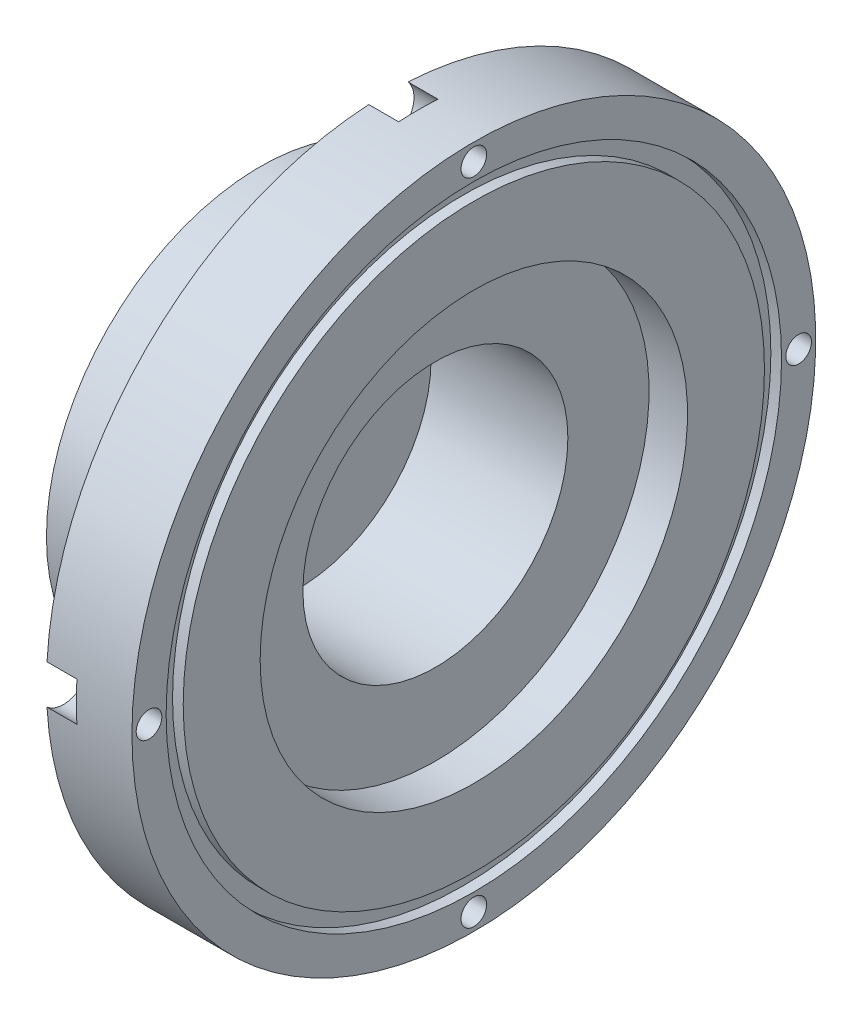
ISO-10303-21;
HEADER;
FILE_DESCRIPTION(('STEP AP214'),'2;1');
FILE_NAME('part.step','',(''),(''),'','','');
FILE_SCHEMA(('AUTOMOTIVE_DESIGN { 1 0 10303 214 1 1 1 1 }'));
ENDSEC;
DATA;
#1=APPLICATION_CONTEXT('core data for automotive mechanical design processes');
#2=APPLICATION_PROTOCOL_DEFINITION('international standard','automotive_design',2000,#1);
#3=PRODUCT_CONTEXT('',#1,'mechanical');
#4=PRODUCT('Part','Part','',(#3));
#5=PRODUCT_RELATED_PRODUCT_CATEGORY('part','',(#4));
#6=PRODUCT_DEFINITION_FORMATION('','',#4);
#7=PRODUCT_DEFINITION_CONTEXT('part definition',#1,'design');
#8=PRODUCT_DEFINITION('design','',#6,#7);
#9=PRODUCT_DEFINITION_SHAPE('','',#8);
#10=(LENGTH_UNIT() NAMED_UNIT(*) SI_UNIT(.MILLI.,.METRE.));
#11=(NAMED_UNIT(*) PLANE_ANGLE_UNIT() SI_UNIT($,.RADIAN.));
#12=(NAMED_UNIT(*) SI_UNIT($,.STERADIAN.) SOLID_ANGLE_UNIT());
#13=UNCERTAINTY_MEASURE_WITH_UNIT(LENGTH_MEASURE(1.E-05),#10,'distance_accuracy_value','');
#14=(GEOMETRIC_REPRESENTATION_CONTEXT(3) GLOBAL_UNCERTAINTY_ASSIGNED_CONTEXT((#13)) GLOBAL_UNIT_ASSIGNED_CONTEXT((#10,
#11,#12)) REPRESENTATION_CONTEXT('',''));
#15=CARTESIAN_POINT('',(0.,0.,0.));
#16=DIRECTION('',(0.,0.,1.));
#17=DIRECTION('',(1.,0.,0.));
#18=AXIS2_PLACEMENT_3D('',#15,#16,#17);
#19=CARTESIAN_POINT('',(25.001,3.98028872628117E-13,38.));
#20=DIRECTION('',(-1.,0.,0.));
#21=DIRECTION('',(0.,0.,1.));
#22=AXIS2_PLACEMENT_3D('',#19,#20,#21);
#23=CYLINDRICAL_SURFACE('',#22,1.5);
#24=CARTESIAN_POINT('',(25.,3.98028872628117E-13,38.));
#25=DIRECTION('',(-1.,0.,0.));
#26=DIRECTION('',(0.,0.,1.));
#27=AXIS2_PLACEMENT_3D('',#24,#25,#26);
#28=CIRCLE('',#27,1.5);
#29=CARTESIAN_POINT('',(25.,3.98028872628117E-13,39.5));
#30=VERTEX_POINT('',#29);
#31=EDGE_CURVE('E198',#30,#30,#28,.F.);
#32=ORIENTED_EDGE('',*,*,#31,.T.);
#33=EDGE_LOOP('',(#32));
#34=FACE_BOUND('',#33,.T.);
#35=CARTESIAN_POINT('',(18.5,3.98028872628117E-13,38.));
#36=DIRECTION('',(-1.,0.,0.));
#37=DIRECTION('',(0.,0.,1.));
#38=AXIS2_PLACEMENT_3D('',#35,#36,#37);
#39=CIRCLE('',#38,1.5);
#40=CARTESIAN_POINT('',(18.5,3.98028872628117E-13,39.5));
#41=VERTEX_POINT('',#40);
#42=EDGE_CURVE('E226',#41,#41,#39,.F.);
#43=ORIENTED_EDGE('',*,*,#42,.F.);
#44=EDGE_LOOP('',(#43));
#45=FACE_BOUND('',#44,.T.);
#46=ADVANCED_FACE('F44',(#34,#45),#23,.F.);
#47=CARTESIAN_POINT('',(25.001,-38.,0.));
#48=DIRECTION('',(-1.,0.,0.));
#49=DIRECTION('',(0.,0.,1.));
#50=AXIS2_PLACEMENT_3D('',#47,#48,#49);
#51=CYLINDRICAL_SURFACE('',#50,1.5);
#52=CARTESIAN_POINT('',(25.,-38.,0.));
#53=DIRECTION('',(-1.,0.,0.));
#54=DIRECTION('',(0.,0.,1.));
#55=AXIS2_PLACEMENT_3D('',#52,#53,#54);
#56=CIRCLE('',#55,1.5);
#57=CARTESIAN_POINT('',(25.,-38.,1.5));
#58=VERTEX_POINT('',#57);
#59=EDGE_CURVE('E202',#58,#58,#56,.F.);
#60=ORIENTED_EDGE('',*,*,#59,.T.);
#61=EDGE_LOOP('',(#60));
#62=FACE_BOUND('',#61,.T.);
#63=CARTESIAN_POINT('',(18.5,-38.,0.));
#64=DIRECTION('',(-1.,0.,0.));
#65=DIRECTION('',(0.,0.,1.));
#66=AXIS2_PLACEMENT_3D('',#63,#64,#65);
#67=CIRCLE('',#66,1.5);
#68=CARTESIAN_POINT('',(18.5,-38.,1.5));
#69=VERTEX_POINT('',#68);
#70=EDGE_CURVE('E230',#69,#69,#67,.F.);
#71=ORIENTED_EDGE('',*,*,#70,.F.);
#72=EDGE_LOOP('',(#71));
#73=FACE_BOUND('',#72,.T.);
#74=ADVANCED_FACE('F284',(#62,#73),#51,.F.);
#75=CARTESIAN_POINT('',(25.001,-1.32676290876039E-13,-38.));
#76=DIRECTION('',(-1.,0.,0.));
#77=DIRECTION('',(0.,0.,1.));
#78=AXIS2_PLACEMENT_3D('',#75,#76,#77);
#79=CYLINDRICAL_SURFACE('',#78,1.5);
#80=CARTESIAN_POINT('',(25.,-1.32676290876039E-13,-38.));
#81=DIRECTION('',(-1.,0.,0.));
#82=DIRECTION('',(0.,0.,1.));
#83=AXIS2_PLACEMENT_3D('',#80,#81,#82);
#84=CIRCLE('',#83,1.5);
#85=CARTESIAN_POINT('',(25.,-1.32676290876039E-13,-36.5));
#86=VERTEX_POINT('',#85);
#87=EDGE_CURVE('E194',#86,#86,#84,.F.);
#88=ORIENTED_EDGE('',*,*,#87,.T.);
#89=EDGE_LOOP('',(#88));
#90=FACE_BOUND('',#89,.T.);
#91=CARTESIAN_POINT('',(18.5,-1.32676290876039E-13,-38.));
#92=DIRECTION('',(-1.,0.,0.));
#93=DIRECTION('',(0.,0.,1.));
#94=AXIS2_PLACEMENT_3D('',#91,#92,#93);
#95=CIRCLE('',#94,1.5);
#96=CARTESIAN_POINT('',(18.5,-1.32676290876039E-13,-36.5));
#97=VERTEX_POINT('',#96);
#98=EDGE_CURVE('E233',#97,#97,#95,.F.);
#99=ORIENTED_EDGE('',*,*,#98,.F.);
#100=EDGE_LOOP('',(#99));
#101=FACE_BOUND('',#100,.T.);
#102=ADVANCED_FACE('F291',(#90,#101),#79,.F.);
#103=CARTESIAN_POINT('',(25.001,38.,0.));
#104=DIRECTION('',(-1.,0.,0.));
#105=DIRECTION('',(0.,0.,1.));
#106=AXIS2_PLACEMENT_3D('',#103,#104,#105);
#107=CYLINDRICAL_SURFACE('',#106,1.5);
#108=CARTESIAN_POINT('',(25.,38.,0.));
#109=DIRECTION('',(-1.,0.,0.));
#110=DIRECTION('',(0.,0.,1.));
#111=AXIS2_PLACEMENT_3D('',#108,#109,#110);
#112=CIRCLE('',#111,1.5);
#113=CARTESIAN_POINT('',(25.,38.,1.5));
#114=VERTEX_POINT('',#113);
#115=EDGE_CURVE('E176',#114,#114,#112,.F.);
#116=ORIENTED_EDGE('',*,*,#115,.T.);
#117=EDGE_LOOP('',(#116));
#118=FACE_BOUND('',#117,.T.);
#119=CARTESIAN_POINT('',(18.5,38.,0.));
#120=DIRECTION('',(-1.,0.,0.));
#121=DIRECTION('',(0.,0.,1.));
#122=AXIS2_PLACEMENT_3D('',#119,#120,#121);
#123=CIRCLE('',#122,1.5);
#124=CARTESIAN_POINT('',(18.5,38.,1.5));
#125=VERTEX_POINT('',#124);
#126=EDGE_CURVE('E190',#125,#125,#123,.F.);
#127=ORIENTED_EDGE('',*,*,#126,.F.);
#128=EDGE_LOOP('',(#127));
#129=FACE_BOUND('',#128,.T.);
#130=ADVANCED_FACE('F306',(#118,#129),#107,.F.);
#131=CARTESIAN_POINT('',(0.,0.,0.));
#132=DIRECTION('',(-1.,0.,0.));
#133=DIRECTION('',(0.,0.,1.));
#134=AXIS2_PLACEMENT_3D('',#131,#132,#133);
#135=CYLINDRICAL_SURFACE('',#134,15.5);
#136=CARTESIAN_POINT('',(9.99604881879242,15.2222149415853,2.92133056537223));
#137=CARTESIAN_POINT('',(10.1492075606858,15.2222178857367,2.92132457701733));
#138=CARTESIAN_POINT('',(10.3024462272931,15.2246908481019,2.90851916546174));
#139=CARTESIAN_POINT('',(10.6046132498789,15.2343169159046,2.8576620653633));
#140=CARTESIAN_POINT('',(10.7535376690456,15.2414741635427,2.81958803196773));
#141=CARTESIAN_POINT('',(11.0426599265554,15.2596698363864,2.71938432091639));
#142=CARTESIAN_POINT('',(11.1828653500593,15.270704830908,2.65727590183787));
#143=CARTESIAN_POINT('',(11.4508338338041,15.2954672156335,2.51081140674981));
#144=CARTESIAN_POINT('',(11.578598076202,15.3091943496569,2.42645744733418));
#145=CARTESIAN_POINT('',(11.8194949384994,15.3380449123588,2.23688105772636));
#146=CARTESIAN_POINT('',(11.9324686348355,15.3531809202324,2.13145856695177));
#147=CARTESIAN_POINT('',(12.1391949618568,15.3831474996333,1.90315607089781));
#148=CARTESIAN_POINT('',(12.2329463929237,15.3979780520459,1.78027497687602));
#149=CARTESIAN_POINT('',(12.3991698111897,15.4259009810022,1.51949498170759));
#150=CARTESIAN_POINT('',(12.4714929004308,15.4389808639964,1.381499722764));
#151=CARTESIAN_POINT('',(12.5918484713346,15.4619370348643,1.09504484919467));
#152=CARTESIAN_POINT('',(12.6398827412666,15.4718135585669,0.946586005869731));
#153=CARTESIAN_POINT('',(12.7098083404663,15.4872995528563,0.645054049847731));
#154=CARTESIAN_POINT('',(12.7319671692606,15.4929524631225,0.492045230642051));
#155=CARTESIAN_POINT('',(12.7503455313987,15.4996667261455,0.184383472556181));
#156=CARTESIAN_POINT('',(12.7465670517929,15.5007284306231,0.0297306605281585));
#157=CARTESIAN_POINT('',(12.7133849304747,15.498301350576,-0.274996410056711));
#158=CARTESIAN_POINT('',(12.6842692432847,15.4948634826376,-0.425102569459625));
#159=CARTESIAN_POINT('',(12.6016936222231,15.4840424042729,-0.718309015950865));
#160=CARTESIAN_POINT('',(12.5482328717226,15.4766590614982,-0.861409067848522));
#161=CARTESIAN_POINT('',(12.4182044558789,15.4588358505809,-1.13737937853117));
#162=CARTESIAN_POINT('',(12.3415199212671,15.4483805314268,-1.27019352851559));
#163=CARTESIAN_POINT('',(12.1673065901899,15.4256884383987,-1.52119774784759));
#164=CARTESIAN_POINT('',(12.0697758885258,15.4134515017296,-1.63938647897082));
#165=CARTESIAN_POINT('',(11.8550467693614,15.3884631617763,-1.85947848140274));
#166=CARTESIAN_POINT('',(11.7375965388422,15.3757069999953,-1.96113568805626));
#167=CARTESIAN_POINT('',(11.487205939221,15.3513715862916,-2.14333036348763));
#168=CARTESIAN_POINT('',(11.3542653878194,15.3397923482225,-2.22386758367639));
#169=CARTESIAN_POINT('',(11.0763619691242,15.3191971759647,-2.36158347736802));
#170=CARTESIAN_POINT('',(10.9313825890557,15.3101848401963,-2.41872940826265));
#171=CARTESIAN_POINT('',(10.6336893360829,15.2958580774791,-2.50774366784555));
#172=CARTESIAN_POINT('',(10.4809762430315,15.2905432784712,-2.53961453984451));
#173=CARTESIAN_POINT('',(10.1743611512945,15.2843181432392,-2.57681477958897));
#174=CARTESIAN_POINT('',(10.0205031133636,15.2833492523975,-2.58249702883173));
#175=CARTESIAN_POINT('',(9.71403753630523,15.2857747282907,-2.5681009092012));
#176=CARTESIAN_POINT('',(9.56142994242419,15.28916890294,-2.5480236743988));
#177=CARTESIAN_POINT('',(9.26293557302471,15.2998644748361,-2.48298390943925));
#178=CARTESIAN_POINT('',(9.11700794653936,15.3071372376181,-2.43820367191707));
#179=CARTESIAN_POINT('',(8.83471338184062,15.3247042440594,-2.32522864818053));
#180=CARTESIAN_POINT('',(8.69834708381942,15.3349986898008,-2.25703229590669));
#181=CARTESIAN_POINT('',(8.43748658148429,15.357519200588,-2.0983489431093));
#182=CARTESIAN_POINT('',(8.31313050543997,15.369764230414,-2.00763762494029));
#183=CARTESIAN_POINT('',(8.08125416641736,15.3946621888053,-1.80681739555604));
#184=CARTESIAN_POINT('',(7.97373525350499,15.407315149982,-1.69670693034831));
#185=CARTESIAN_POINT('',(7.7772843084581,15.4316808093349,-1.45865827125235));
#186=CARTESIAN_POINT('',(7.68858816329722,15.4433805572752,-1.33052389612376));
#187=CARTESIAN_POINT('',(7.53395903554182,15.4642340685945,-1.06099406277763));
#188=CARTESIAN_POINT('',(7.4680252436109,15.4733879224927,-0.919599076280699));
#189=CARTESIAN_POINT('',(7.36115254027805,15.4879455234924,-0.628248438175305));
#190=CARTESIAN_POINT('',(7.32009401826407,15.4933672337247,-0.478337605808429));
#191=CARTESIAN_POINT('',(7.26375383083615,15.4997755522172,-0.173659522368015));
#192=CARTESIAN_POINT('',(7.24846974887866,15.5007625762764,-0.0188927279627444));
#193=CARTESIAN_POINT('',(7.24418918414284,15.4980621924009,0.288832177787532));
#194=CARTESIAN_POINT('',(7.25483513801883,15.4944386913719,0.441785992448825));
#195=CARTESIAN_POINT('',(7.30133416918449,15.482887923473,0.743640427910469));
#196=CARTESIAN_POINT('',(7.33718705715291,15.4749606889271,0.892541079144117));
#197=CARTESIAN_POINT('',(7.43293813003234,15.4555529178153,1.18190535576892));
#198=CARTESIAN_POINT('',(7.492802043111,15.4440774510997,1.32238067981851));
#199=CARTESIAN_POINT('',(7.63483458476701,15.4186891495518,1.59131761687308));
#200=CARTESIAN_POINT('',(7.71700449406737,15.4047761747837,1.71977853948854));
#201=CARTESIAN_POINT('',(7.90256577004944,15.3757097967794,1.9628409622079));
#202=CARTESIAN_POINT('',(8.0062172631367,15.3605427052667,2.07724225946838));
#203=CARTESIAN_POINT('',(8.23125623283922,15.3306944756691,2.28715464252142));
#204=CARTESIAN_POINT('',(8.35264786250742,15.3160134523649,2.38266129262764));
#205=CARTESIAN_POINT('',(8.61090043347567,15.2885797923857,2.55280962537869));
#206=CARTESIAN_POINT('',(8.74787932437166,15.2758438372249,2.62727501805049));
#207=CARTESIAN_POINT('',(9.03258686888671,15.2538596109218,2.7520564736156));
#208=CARTESIAN_POINT('',(9.18030491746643,15.2446079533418,2.80239599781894));
#209=CARTESIAN_POINT('',(9.43978365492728,15.2325795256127,2.86692311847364));
#210=CARTESIAN_POINT('',(9.54999817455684,15.2287142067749,2.88729223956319));
#211=CARTESIAN_POINT('',(9.77214385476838,15.2235308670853,2.91449800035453));
#212=CARTESIAN_POINT('',(9.88407497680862,15.2222127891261,2.9213349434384));
#213=CARTESIAN_POINT('',(9.99604881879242,15.2222149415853,2.92133056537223));
#214=B_SPLINE_CURVE_WITH_KNOTS('',3,(#136,#137,#138,#139,#140,#141,#142,#143,#144,#145,#146,
#147,#148,#149,#150,#151,#152,#153,#154,#155,#156,#157,#158,#159,#160,#161,#162,#163,#164,#165,
#166,#167,#168,#169,#170,#171,#172,#173,#174,#175,#176,#177,#178,#179,#180,#181,#182,#183,#184,
#185,#186,#187,#188,#189,#190,#191,#192,#193,#194,#195,#196,#197,#198,#199,#200,#201,#202,#203,
#204,#205,#206,#207,#208,#209,#210,#211,#212,#213),.UNSPECIFIED.,.T.,.F.,(4,2,2,2,2,2,2,2,2,2,2,
2,2,2,2,2,2,2,2,2,2,2,2,2,2,2,2,2,2,2,2,2,2,2,2,2,2,2,4),(0.,0.459066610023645,
0.918539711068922,1.37760733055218,1.83663128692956,2.30024096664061,2.7638795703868,
3.23066809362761,3.69742224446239,4.1593071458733,4.62115666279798,5.07782486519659,
5.53450838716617,5.99352938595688,6.45259235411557,6.91796260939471,7.38333834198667,
7.84936328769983,8.31534133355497,8.77502178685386,9.2346820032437,9.69099473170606,
10.1473379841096,10.6084243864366,11.069547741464,11.5361470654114,12.0027297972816,
12.4670508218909,12.931328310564,13.3892399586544,13.8471481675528,14.3044050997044,
14.7616882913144,15.224871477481,15.6881632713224,16.1552287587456,16.6218391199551,
16.9574687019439,17.2930907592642),.UNSPECIFIED.);
#215=CARTESIAN_POINT('',(9.99604881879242,15.2222149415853,2.92133056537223));
#216=VERTEX_POINT('',#215);
#217=EDGE_CURVE('E238',#216,#216,#214,.T.);
#218=ORIENTED_EDGE('',*,*,#217,.T.);
#219=EDGE_LOOP('',(#218));
#220=FACE_BOUND('',#219,.T.);
#221=CARTESIAN_POINT('',(20.5,0.,0.));
#222=DIRECTION('',(-1.,0.,0.));
#223=DIRECTION('',(0.,0.,1.));
#224=AXIS2_PLACEMENT_3D('',#221,#222,#223);
#225=CIRCLE('',#224,15.5);
#226=CARTESIAN_POINT('',(20.5,0.,15.5));
#227=VERTEX_POINT('',#226);
#228=EDGE_CURVE('E58',#227,#227,#225,.T.);
#229=ORIENTED_EDGE('',*,*,#228,.F.);
#230=EDGE_LOOP('',(#229));
#231=FACE_BOUND('',#230,.T.);
#232=CARTESIAN_POINT('',(4.5,0.,0.));
#233=DIRECTION('',(-1.,0.,0.));
#234=DIRECTION('',(0.,0.,1.));
#235=AXIS2_PLACEMENT_3D('',#232,#233,#234);
#236=CIRCLE('',#235,15.5);
#237=CARTESIAN_POINT('',(4.5,0.,15.5));
#238=VERTEX_POINT('',#237);
#239=EDGE_CURVE('E170',#238,#238,#236,.T.);
#240=ORIENTED_EDGE('',*,*,#239,.T.);
#241=EDGE_LOOP('',(#240));
#242=FACE_BOUND('',#241,.T.);
#243=ADVANCED_FACE('F46',(#220,#231,#242),#135,.F.);
#244=CARTESIAN_POINT('',(20.5,15.5,0.));
#245=DIRECTION('',(-1.,0.,0.));
#246=DIRECTION('',(0.,0.,1.));
#247=AXIS2_PLACEMENT_3D('',#244,#245,#246);
#248=PLANE('',#247);
#249=CARTESIAN_POINT('',(20.5,0.,0.));
#250=DIRECTION('',(-1.,0.,0.));
#251=DIRECTION('',(0.,0.,1.));
#252=AXIS2_PLACEMENT_3D('',#249,#250,#251);
#253=CIRCLE('',#252,25.);
#254=CARTESIAN_POINT('',(20.5,0.,25.));
#255=VERTEX_POINT('',#254);
#256=EDGE_CURVE('E359',#255,#255,#253,.T.);
#257=ORIENTED_EDGE('',*,*,#256,.F.);
#258=EDGE_LOOP('',(#257));
#259=FACE_BOUND('',#258,.T.);
#260=ORIENTED_EDGE('',*,*,#228,.T.);
#261=EDGE_LOOP('',(#260));
#262=FACE_BOUND('',#261,.T.);
#263=ADVANCED_FACE('F347',(#259,#262),#248,.F.);
#264=CARTESIAN_POINT('',(0.,0.,0.));
#265=DIRECTION('',(-1.,0.,0.));
#266=DIRECTION('',(0.,0.,1.));
#267=AXIS2_PLACEMENT_3D('',#264,#265,#266);
#268=CYLINDRICAL_SURFACE('',#267,25.);
#269=CARTESIAN_POINT('',(25.,0.,0.));
#270=DIRECTION('',(-1.,0.,0.));
#271=DIRECTION('',(0.,0.,1.));
#272=AXIS2_PLACEMENT_3D('',#269,#270,#271);
#273=CIRCLE('',#272,25.);
#274=CARTESIAN_POINT('',(25.,0.,25.));
#275=VERTEX_POINT('',#274);
#276=EDGE_CURVE('E366',#275,#275,#273,.T.);
#277=ORIENTED_EDGE('',*,*,#276,.F.);
#278=EDGE_LOOP('',(#277));
#279=FACE_BOUND('',#278,.T.);
#280=ORIENTED_EDGE('',*,*,#256,.T.);
#281=EDGE_LOOP('',(#280));
#282=FACE_BOUND('',#281,.T.);
#283=ADVANCED_FACE('F344',(#279,#282),#268,.F.);
#284=CARTESIAN_POINT('',(25.,25.,0.));
#285=DIRECTION('',(-1.,0.,0.));
#286=DIRECTION('',(0.,0.,1.));
#287=AXIS2_PLACEMENT_3D('',#284,#285,#286);
#288=PLANE('',#287);
#289=CARTESIAN_POINT('',(25.,0.,0.));
#290=DIRECTION('',(-1.,0.,0.));
#291=DIRECTION('',(0.,0.,1.));
#292=AXIS2_PLACEMENT_3D('',#289,#290,#291);
#293=CIRCLE('',#292,34.);
#294=CARTESIAN_POINT('',(25.,0.,34.));
#295=VERTEX_POINT('',#294);
#296=EDGE_CURVE('E650',#295,#295,#293,.T.);
#297=ORIENTED_EDGE('',*,*,#296,.F.);
#298=EDGE_LOOP('',(#297));
#299=FACE_BOUND('',#298,.T.);
#300=ORIENTED_EDGE('',*,*,#276,.T.);
#301=EDGE_LOOP('',(#300));
#302=FACE_BOUND('',#301,.T.);
#303=ADVANCED_FACE('F340',(#299,#302),#288,.F.);
#304=CARTESIAN_POINT('',(0.,0.,0.));
#305=DIRECTION('',(-1.,0.,0.));
#306=DIRECTION('',(0.,0.,1.));
#307=AXIS2_PLACEMENT_3D('',#304,#305,#306);
#308=CYLINDRICAL_SURFACE('',#307,34.);
#309=CARTESIAN_POINT('',(23.75,0.,0.));
#310=DIRECTION('',(-1.,0.,0.));
#311=DIRECTION('',(0.,0.,1.));
#312=AXIS2_PLACEMENT_3D('',#309,#310,#311);
#313=CIRCLE('',#312,34.);
#314=CARTESIAN_POINT('',(23.75,0.,34.));
#315=VERTEX_POINT('',#314);
#316=EDGE_CURVE('E644',#315,#315,#313,.T.);
#317=ORIENTED_EDGE('',*,*,#316,.F.);
#318=EDGE_LOOP('',(#317));
#319=FACE_BOUND('',#318,.T.);
#320=ORIENTED_EDGE('',*,*,#296,.T.);
#321=EDGE_LOOP('',(#320));
#322=FACE_BOUND('',#321,.T.);
#323=ADVANCED_FACE('F336',(#319,#322),#308,.T.);
#324=CARTESIAN_POINT('',(23.75,34.,0.));
#325=DIRECTION('',(-1.,0.,0.));
#326=DIRECTION('',(0.,0.,1.));
#327=AXIS2_PLACEMENT_3D('',#324,#325,#326);
#328=PLANE('',#327);
#329=CARTESIAN_POINT('',(23.75,0.,0.));
#330=DIRECTION('',(-1.,0.,0.));
#331=DIRECTION('',(0.,0.,1.));
#332=AXIS2_PLACEMENT_3D('',#329,#330,#331);
#333=CIRCLE('',#332,36.);
#334=CARTESIAN_POINT('',(23.75,0.,36.));
#335=VERTEX_POINT('',#334);
#336=EDGE_CURVE('E640',#335,#335,#333,.T.);
#337=ORIENTED_EDGE('',*,*,#336,.F.);
#338=EDGE_LOOP('',(#337));
#339=FACE_BOUND('',#338,.T.);
#340=ORIENTED_EDGE('',*,*,#316,.T.);
#341=EDGE_LOOP('',(#340));
#342=FACE_BOUND('',#341,.T.);
#343=ADVANCED_FACE('F332',(#339,#342),#328,.F.);
#344=CARTESIAN_POINT('',(0.,0.,0.));
#345=DIRECTION('',(-1.,0.,0.));
#346=DIRECTION('',(0.,0.,1.));
#347=AXIS2_PLACEMENT_3D('',#344,#345,#346);
#348=CYLINDRICAL_SURFACE('',#347,36.);
#349=CARTESIAN_POINT('',(25.,0.,0.));
#350=DIRECTION('',(-1.,0.,0.));
#351=DIRECTION('',(0.,0.,1.));
#352=AXIS2_PLACEMENT_3D('',#349,#350,#351);
#353=CIRCLE('',#352,36.);
#354=CARTESIAN_POINT('',(25.,0.,36.));
#355=VERTEX_POINT('',#354);
#356=EDGE_CURVE('E154',#355,#355,#353,.T.);
#357=ORIENTED_EDGE('',*,*,#356,.F.);
#358=EDGE_LOOP('',(#357));
#359=FACE_BOUND('',#358,.T.);
#360=ORIENTED_EDGE('',*,*,#336,.T.);
#361=EDGE_LOOP('',(#360));
#362=FACE_BOUND('',#361,.T.);
#363=ADVANCED_FACE('F328',(#359,#362),#348,.F.);
#364=CARTESIAN_POINT('',(25.,36.,0.));
#365=DIRECTION('',(-1.,0.,0.));
#366=DIRECTION('',(0.,0.,1.));
#367=AXIS2_PLACEMENT_3D('',#364,#365,#366);
#368=PLANE('',#367);
#369=ORIENTED_EDGE('',*,*,#87,.F.);
#370=EDGE_LOOP('',(#369));
#371=FACE_BOUND('',#370,.T.);
#372=ORIENTED_EDGE('',*,*,#59,.F.);
#373=EDGE_LOOP('',(#372));
#374=FACE_BOUND('',#373,.T.);
#375=ORIENTED_EDGE('',*,*,#31,.F.);
#376=EDGE_LOOP('',(#375));
#377=FACE_BOUND('',#376,.T.);
#378=ORIENTED_EDGE('',*,*,#115,.F.);
#379=EDGE_LOOP('',(#378));
#380=FACE_BOUND('',#379,.T.);
#381=CARTESIAN_POINT('',(25.,0.,0.));
#382=DIRECTION('',(-1.,0.,0.));
#383=DIRECTION('',(0.,0.,1.));
#384=AXIS2_PLACEMENT_3D('',#381,#382,#383);
#385=CIRCLE('',#384,40.);
#386=CARTESIAN_POINT('',(25.,0.,40.));
#387=VERTEX_POINT('',#386);
#388=EDGE_CURVE('E147',#387,#387,#385,.T.);
#389=ORIENTED_EDGE('',*,*,#388,.F.);
#390=EDGE_LOOP('',(#389));
#391=FACE_BOUND('',#390,.T.);
#392=ORIENTED_EDGE('',*,*,#356,.T.);
#393=EDGE_LOOP('',(#392));
#394=FACE_BOUND('',#393,.T.);
#395=ADVANCED_FACE('F325',(#371,#374,#377,#380,#391,#394),#368,.F.);
#396=CARTESIAN_POINT('',(0.,0.,0.));
#397=DIRECTION('',(-1.,0.,0.));
#398=DIRECTION('',(0.,0.,1.));
#399=AXIS2_PLACEMENT_3D('',#396,#397,#398);
#400=CYLINDRICAL_SURFACE('',#399,40.);
#401=CARTESIAN_POINT('',(15.,0.,0.));
#402=DIRECTION('',(-1.,0.,0.));
#403=DIRECTION('',(0.,0.,1.));
#404=AXIS2_PLACEMENT_3D('',#401,#402,#403);
#405=CIRCLE('',#404,40.);
#406=CARTESIAN_POINT('',(15.,-2.29321382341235,-39.9342105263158));
#407=VERTEX_POINT('',#406);
#408=CARTESIAN_POINT('',(15.,-39.9342105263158,-2.29321382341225));
#409=VERTEX_POINT('',#408);
#410=EDGE_CURVE('E148',#407,#409,#405,.T.);
#411=ORIENTED_EDGE('',*,*,#410,.F.);
#412=DIRECTION('',(-1.,0.,0.));
#413=VECTOR('',#412,1.);
#414=CARTESIAN_POINT('',(16.75,-2.29321382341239,-39.9342105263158));
#415=LINE('',#414,#413);
#416=CARTESIAN_POINT('',(18.5,-2.29321382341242,-39.9342105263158));
#417=VERTEX_POINT('',#416);
#418=EDGE_CURVE('E123',#407,#417,#415,.F.);
#419=ORIENTED_EDGE('',*,*,#418,.T.);
#420=CARTESIAN_POINT('',(18.5,0.,0.));
#421=DIRECTION('',(-1.,0.,0.));
#422=DIRECTION('',(0.,0.,1.));
#423=AXIS2_PLACEMENT_3D('',#420,#421,#422);
#424=CIRCLE('',#423,40.);
#425=CARTESIAN_POINT('',(18.5,2.29321382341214,-39.9342105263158));
#426=VERTEX_POINT('',#425);
#427=EDGE_CURVE('E139',#426,#417,#424,.T.);
#428=ORIENTED_EDGE('',*,*,#427,.F.);
#429=DIRECTION('',(-1.,0.,0.));
#430=VECTOR('',#429,1.);
#431=CARTESIAN_POINT('',(16.75,2.29321382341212,-39.9342105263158));
#432=LINE('',#431,#430);
#433=CARTESIAN_POINT('',(15.,2.29321382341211,-39.9342105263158));
#434=VERTEX_POINT('',#433);
#435=EDGE_CURVE('E120',#426,#434,#432,.T.);
#436=ORIENTED_EDGE('',*,*,#435,.T.);
#437=CARTESIAN_POINT('',(15.,39.9342105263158,-2.29321382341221));
#438=VERTEX_POINT('',#437);
#439=EDGE_CURVE('E138',#438,#434,#405,.T.);
#440=ORIENTED_EDGE('',*,*,#439,.F.);
#441=DIRECTION('',(-1.,0.,0.));
#442=VECTOR('',#441,1.);
#443=CARTESIAN_POINT('',(16.75,39.9342105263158,-2.29321382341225));
#444=LINE('',#443,#442);
#445=CARTESIAN_POINT('',(18.5,39.9342105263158,-2.29321382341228));
#446=VERTEX_POINT('',#445);
#447=EDGE_CURVE('E180',#438,#446,#444,.F.);
#448=ORIENTED_EDGE('',*,*,#447,.T.);
#449=CARTESIAN_POINT('',(18.5,0.,0.));
#450=DIRECTION('',(-1.,0.,0.));
#451=DIRECTION('',(0.,0.,1.));
#452=AXIS2_PLACEMENT_3D('',#449,#450,#451);
#453=CIRCLE('',#452,40.);
#454=CARTESIAN_POINT('',(18.5,39.9342105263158,2.29321382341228));
#455=VERTEX_POINT('',#454);
#456=EDGE_CURVE('E187',#455,#446,#453,.T.);
#457=ORIENTED_EDGE('',*,*,#456,.F.);
#458=DIRECTION('',(-1.,0.,0.));
#459=VECTOR('',#458,1.);
#460=CARTESIAN_POINT('',(16.75,39.9342105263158,2.29321382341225));
#461=LINE('',#460,#459);
#462=CARTESIAN_POINT('',(15.,39.9342105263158,2.29321382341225));
#463=VERTEX_POINT('',#462);
#464=EDGE_CURVE('E183',#455,#463,#461,.T.);
#465=ORIENTED_EDGE('',*,*,#464,.T.);
#466=CARTESIAN_POINT('',(15.,2.29321382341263,39.9342105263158));
#467=VERTEX_POINT('',#466);
#468=EDGE_CURVE('E150',#467,#463,#405,.T.);
#469=ORIENTED_EDGE('',*,*,#468,.F.);
#470=DIRECTION('',(-1.,0.,0.));
#471=VECTOR('',#470,1.);
#472=CARTESIAN_POINT('',(16.75,2.29321382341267,39.9342105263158));
#473=LINE('',#472,#471);
#474=CARTESIAN_POINT('',(18.5,2.2932138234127,39.9342105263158));
#475=VERTEX_POINT('',#474);
#476=EDGE_CURVE('E65',#467,#475,#473,.F.);
#477=ORIENTED_EDGE('',*,*,#476,.T.);
#478=CARTESIAN_POINT('',(18.5,0.,0.));
#479=DIRECTION('',(-1.,0.,0.));
#480=DIRECTION('',(0.,0.,1.));
#481=AXIS2_PLACEMENT_3D('',#478,#479,#480);
#482=CIRCLE('',#481,40.);
#483=CARTESIAN_POINT('',(18.5,-2.29321382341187,39.9342105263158));
#484=VERTEX_POINT('',#483);
#485=EDGE_CURVE('E223',#484,#475,#482,.T.);
#486=ORIENTED_EDGE('',*,*,#485,.F.);
#487=DIRECTION('',(-1.,0.,0.));
#488=VECTOR('',#487,1.);
#489=CARTESIAN_POINT('',(16.75,-2.29321382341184,39.9342105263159));
#490=LINE('',#489,#488);
#491=CARTESIAN_POINT('',(15.,-2.29321382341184,39.9342105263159));
#492=VERTEX_POINT('',#491);
#493=EDGE_CURVE('E219',#484,#492,#490,.T.);
#494=ORIENTED_EDGE('',*,*,#493,.T.);
#495=CARTESIAN_POINT('',(15.,-39.9342105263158,2.29321382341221));
#496=VERTEX_POINT('',#495);
#497=EDGE_CURVE('E156',#496,#492,#405,.T.);
#498=ORIENTED_EDGE('',*,*,#497,.F.);
#499=DIRECTION('',(-1.,0.,0.));
#500=VECTOR('',#499,1.);
#501=CARTESIAN_POINT('',(16.75,-39.9342105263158,2.29321382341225));
#502=LINE('',#501,#500);
#503=CARTESIAN_POINT('',(18.5,-39.9342105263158,2.29321382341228));
#504=VERTEX_POINT('',#503);
#505=EDGE_CURVE('E73',#496,#504,#502,.F.);
#506=ORIENTED_EDGE('',*,*,#505,.T.);
#507=CARTESIAN_POINT('',(18.5,0.,0.));
#508=DIRECTION('',(-1.,0.,0.));
#509=DIRECTION('',(0.,0.,1.));
#510=AXIS2_PLACEMENT_3D('',#507,#508,#509);
#511=CIRCLE('',#510,40.);
#512=CARTESIAN_POINT('',(18.5,-39.9342105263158,-2.29321382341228));
#513=VERTEX_POINT('',#512);
#514=EDGE_CURVE('E227',#513,#504,#511,.T.);
#515=ORIENTED_EDGE('',*,*,#514,.F.);
#516=DIRECTION('',(-1.,0.,0.));
#517=VECTOR('',#516,1.);
#518=CARTESIAN_POINT('',(16.75,-39.9342105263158,-2.29321382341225));
#519=LINE('',#518,#517);
#520=EDGE_CURVE('E213',#513,#409,#519,.T.);
#521=ORIENTED_EDGE('',*,*,#520,.T.);
#522=EDGE_LOOP('',(#411,#419,#428,#436,#440,#448,#457,#465,#469,#477,#486,#494,#498,#506,#515,#521));
#523=FACE_BOUND('',#522,.T.);
#524=ORIENTED_EDGE('',*,*,#388,.T.);
#525=EDGE_LOOP('',(#524));
#526=FACE_BOUND('',#525,.T.);
#527=ADVANCED_FACE('F135',(#523,#526),#400,.T.);
#528=CARTESIAN_POINT('',(15.,40.,0.));
#529=DIRECTION('',(1.,0.,0.));
#530=DIRECTION('',(0.,0.,-1.));
#531=AXIS2_PLACEMENT_3D('',#528,#529,#530);
#532=PLANE('',#531);
#533=CARTESIAN_POINT('',(15.,0.,0.));
#534=DIRECTION('',(-1.,0.,0.));
#535=DIRECTION('',(0.,0.,1.));
#536=AXIS2_PLACEMENT_3D('',#533,#534,#535);
#537=CIRCLE('',#536,25.);
#538=CARTESIAN_POINT('',(15.,0.,25.));
#539=VERTEX_POINT('',#538);
#540=EDGE_CURVE('E159',#539,#539,#537,.T.);
#541=ORIENTED_EDGE('',*,*,#540,.F.);
#542=EDGE_LOOP('',(#541));
#543=FACE_BOUND('',#542,.T.);
#544=ORIENTED_EDGE('',*,*,#439,.T.);
#545=CARTESIAN_POINT('',(15.,-1.32676290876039E-13,-38.));
#546=DIRECTION('',(-1.,0.,0.));
#547=DIRECTION('',(0.,1.,0.));
#548=AXIS2_PLACEMENT_3D('',#545,#546,#547);
#549=CIRCLE('',#548,3.);
#550=EDGE_CURVE('E116',#407,#434,#549,.T.);
#551=ORIENTED_EDGE('',*,*,#550,.F.);
#552=ORIENTED_EDGE('',*,*,#410,.T.);
#553=CARTESIAN_POINT('',(15.,-38.,0.));
#554=DIRECTION('',(-1.,0.,0.));
#555=DIRECTION('',(0.,0.,-1.));
#556=AXIS2_PLACEMENT_3D('',#553,#554,#555);
#557=CIRCLE('',#556,3.);
#558=EDGE_CURVE('E242',#496,#409,#557,.T.);
#559=ORIENTED_EDGE('',*,*,#558,.F.);
#560=ORIENTED_EDGE('',*,*,#497,.T.);
#561=CARTESIAN_POINT('',(15.,3.98028872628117E-13,38.));
#562=DIRECTION('',(-1.,0.,0.));
#563=DIRECTION('',(0.,-1.,0.));
#564=AXIS2_PLACEMENT_3D('',#561,#562,#563);
#565=CIRCLE('',#564,3.);
#566=EDGE_CURVE('E234',#467,#492,#565,.T.);
#567=ORIENTED_EDGE('',*,*,#566,.F.);
#568=ORIENTED_EDGE('',*,*,#468,.T.);
#569=CARTESIAN_POINT('',(15.,38.,0.));
#570=DIRECTION('',(-1.,0.,0.));
#571=DIRECTION('',(0.,0.,1.));
#572=AXIS2_PLACEMENT_3D('',#569,#570,#571);
#573=CIRCLE('',#572,3.);
#574=EDGE_CURVE('E145',#438,#463,#573,.T.);
#575=ORIENTED_EDGE('',*,*,#574,.F.);
#576=EDGE_LOOP('',(#544,#551,#552,#559,#560,#567,#568,#575));
#577=FACE_BOUND('',#576,.T.);
#578=ADVANCED_FACE('F143',(#543,#577),#532,.F.);
#579=CARTESIAN_POINT('',(0.,0.,0.));
#580=DIRECTION('',(-1.,0.,0.));
#581=DIRECTION('',(0.,0.,1.));
#582=AXIS2_PLACEMENT_3D('',#579,#580,#581);
#583=CYLINDRICAL_SURFACE('',#582,25.);
#584=CARTESIAN_POINT('',(9.99604881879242,24.5395166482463,4.77620379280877));
#585=CARTESIAN_POINT('',(9.74548852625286,24.5395215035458,4.77619405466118));
#586=CARTESIAN_POINT('',(9.49479899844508,24.5436234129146,4.75525086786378));
#587=CARTESIAN_POINT('',(9.00047572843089,24.5595892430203,4.67207678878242));
#588=CARTESIAN_POINT('',(8.75684836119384,24.5714599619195,4.60980973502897));
#589=CARTESIAN_POINT('',(8.28387391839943,24.6016362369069,4.44594038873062));
#590=CARTESIAN_POINT('',(8.05451426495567,24.6199360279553,4.34437332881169));
#591=CARTESIAN_POINT('',(7.61614229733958,24.6609975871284,4.10486226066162));
#592=CARTESIAN_POINT('',(7.40712813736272,24.6837589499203,3.9669215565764));
#593=CARTESIAN_POINT('',(7.01296217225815,24.7316009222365,3.65687079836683));
#594=CARTESIAN_POINT('',(6.82807780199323,24.7567029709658,3.48442401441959));
#595=CARTESIAN_POINT('',(6.48974701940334,24.8063972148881,3.1109607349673));
#596=CARTESIAN_POINT('',(6.33630259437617,24.8309893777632,2.9099424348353));
#597=CARTESIAN_POINT('',(6.06419029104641,24.8772916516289,2.48327537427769));
#598=CARTESIAN_POINT('',(5.94577337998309,24.8989803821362,2.25746404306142));
#599=CARTESIAN_POINT('',(5.74869300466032,24.9370368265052,1.78869324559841));
#600=CARTESIAN_POINT('',(5.6700265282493,24.9534049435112,1.54573508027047));
#601=CARTESIAN_POINT('',(5.55550376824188,24.9790505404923,1.05232130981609));
#602=CARTESIAN_POINT('',(5.51919715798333,24.9884022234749,0.801974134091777));
#603=CARTESIAN_POINT('',(5.489022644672,24.9994841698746,0.298577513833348));
#604=CARTESIAN_POINT('',(5.49515139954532,25.0012150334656,0.0455282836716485));
#605=CARTESIAN_POINT('',(5.54932610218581,24.9971246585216,-0.453002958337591));
#606=CARTESIAN_POINT('',(5.59688725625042,24.9913903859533,-0.698538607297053));
#607=CARTESIAN_POINT('',(5.73181118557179,24.973377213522,-1.17816028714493));
#608=CARTESIAN_POINT('',(5.81917532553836,24.9610980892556,-1.41224592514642));
#609=CARTESIAN_POINT('',(6.03169457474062,24.9314663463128,-1.86372965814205));
#610=CARTESIAN_POINT('',(6.15704569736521,24.9140874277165,-2.08103368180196));
#611=CARTESIAN_POINT('',(6.44183654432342,24.8763709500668,-2.49173949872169));
#612=CARTESIAN_POINT('',(6.60127947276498,24.8560331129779,-2.68513904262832));
#613=CARTESIAN_POINT('',(6.95240599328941,24.8144908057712,-3.0453986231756));
#614=CARTESIAN_POINT('',(7.14451358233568,24.7932781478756,-3.21184473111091));
#615=CARTESIAN_POINT('',(7.5540977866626,24.7528035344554,-3.51019290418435));
#616=CARTESIAN_POINT('',(7.7715747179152,24.7335416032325,-3.64209453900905));
#617=CARTESIAN_POINT('',(8.22624737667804,24.6992721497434,-3.86769405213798));
#618=CARTESIAN_POINT('',(8.46347158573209,24.6842709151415,-3.96133555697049));
#619=CARTESIAN_POINT('',(8.95060911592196,24.660413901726,-4.10725046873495));
#620=CARTESIAN_POINT('',(9.20052111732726,24.651557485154,-4.15952816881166));
#621=CARTESIAN_POINT('',(9.70221780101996,24.6411705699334,-4.22062461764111));
#622=CARTESIAN_POINT('',(9.95392811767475,24.639539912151,-4.23003758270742));
#623=CARTESIAN_POINT('',(10.4553219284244,24.6435305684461,-4.20672507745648));
#624=CARTESIAN_POINT('',(10.7050055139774,24.6491515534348,-4.17400151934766));
#625=CARTESIAN_POINT('',(11.1933332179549,24.6668877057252,-4.06785947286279));
#626=CARTESIAN_POINT('',(11.4320462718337,24.6789536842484,-3.99474907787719));
#627=CARTESIAN_POINT('',(11.8938571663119,24.7081098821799,-3.81024626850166));
#628=CARTESIAN_POINT('',(12.1169539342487,24.725200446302,-3.69885122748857));
#629=CARTESIAN_POINT('',(12.543822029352,24.762604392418,-3.4395780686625));
#630=CARTESIAN_POINT('',(12.7473614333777,24.7829502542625,-3.29132290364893));
#631=CARTESIAN_POINT('',(13.126927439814,24.8243330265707,-2.96307119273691));
#632=CARTESIAN_POINT('',(13.3029517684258,24.8453699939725,-2.78307202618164));
#633=CARTESIAN_POINT('',(13.6246878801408,24.8859058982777,-2.39381912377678));
#634=CARTESIAN_POINT('',(13.7700020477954,24.9053828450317,-2.1842341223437));
#635=CARTESIAN_POINT('',(14.0233946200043,24.9401213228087,-1.74332418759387));
#636=CARTESIAN_POINT('',(14.1314743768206,24.9553830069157,-1.51200004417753));
#637=CARTESIAN_POINT('',(14.3067260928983,24.9796861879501,-1.03532529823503));
#638=CARTESIAN_POINT('',(14.374098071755,24.9887581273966,-0.790049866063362));
#639=CARTESIAN_POINT('',(14.4666624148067,24.9995426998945,-0.291514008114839));
#640=CARTESIAN_POINT('',(14.4918588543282,25.0012560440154,-0.0382543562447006));
#641=CARTESIAN_POINT('',(14.4992241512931,24.9969209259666,0.46523445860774));
#642=CARTESIAN_POINT('',(14.4819951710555,24.9909816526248,0.715455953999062));
#643=CARTESIAN_POINT('',(14.4063114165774,24.971957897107,1.20929638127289));
#644=CARTESIAN_POINT('',(14.3478569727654,24.9588734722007,1.45291536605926));
#645=CARTESIAN_POINT('',(14.19162708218,24.9268008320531,1.92635958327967));
#646=CARTESIAN_POINT('',(14.0939109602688,24.9078215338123,2.15620502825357));
#647=CARTESIAN_POINT('',(13.8620016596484,24.8658049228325,2.5962795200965));
#648=CARTESIAN_POINT('',(13.727806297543,24.8427673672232,2.80650739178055));
#649=CARTESIAN_POINT('',(13.4246517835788,24.7946067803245,3.20440737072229));
#650=CARTESIAN_POINT('',(13.255255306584,24.7694601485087,3.39174346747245));
#651=CARTESIAN_POINT('',(12.8874189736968,24.7199505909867,3.73554386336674));
#652=CARTESIAN_POINT('',(12.6889723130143,24.6955878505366,3.8920009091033));
#653=CARTESIAN_POINT('',(12.2666745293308,24.6500341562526,4.1708516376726));
#654=CARTESIAN_POINT('',(12.0426235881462,24.628871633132,4.29294744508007));
#655=CARTESIAN_POINT('',(11.57687483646,24.5923197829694,4.49763361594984));
#656=CARTESIAN_POINT('',(11.3351943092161,24.5769248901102,4.58026208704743));
#657=CARTESIAN_POINT('',(10.9099347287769,24.5568545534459,4.68645669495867));
#658=CARTESIAN_POINT('',(10.7288789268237,24.5503889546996,4.72005585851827));
#659=CARTESIAN_POINT('',(10.3639215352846,24.5417182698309,4.76493271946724));
#660=CARTESIAN_POINT('',(10.1800200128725,24.539513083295,4.77621094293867));
#661=CARTESIAN_POINT('',(9.99604881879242,24.5395166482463,4.77620379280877));
#662=B_SPLINE_CURVE_WITH_KNOTS('',3,(#584,#585,#586,#587,#588,#589,#590,#591,#592,#593,#594,
#595,#596,#597,#598,#599,#600,#601,#602,#603,#604,#605,#606,#607,#608,#609,#610,#611,#612,#613,
#614,#615,#616,#617,#618,#619,#620,#621,#622,#623,#624,#625,#626,#627,#628,#629,#630,#631,#632,
#633,#634,#635,#636,#637,#638,#639,#640,#641,#642,#643,#644,#645,#646,#647,#648,#649,#650,#651,
#652,#653,#654,#655,#656,#657,#658,#659,#660,#661),.UNSPECIFIED.,.T.,.F.,(4,2,2,2,2,2,2,2,2,2,2,
2,2,2,2,2,2,2,2,2,2,2,2,2,2,2,2,2,2,2,2,2,2,2,2,2,2,2,4),(0.,0.751007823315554,1.50267370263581,
2.2536672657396,3.00459263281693,3.76323862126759,4.52193254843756,5.28593759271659,
6.04988473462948,6.80563415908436,7.56132406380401,8.30828875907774,9.05527906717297,
9.80619145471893,10.5571744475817,11.3187761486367,12.0803873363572,12.8431166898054,
13.6057668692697,14.357811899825,15.1098228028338,15.8561746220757,16.6025776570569,
17.3569547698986,18.1113941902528,18.8750727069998,19.6387234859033,20.3985908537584,
21.1583847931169,21.9074569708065,22.6565231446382,23.4044617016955,24.1524450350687,
24.9103454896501,25.6684237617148,26.4328844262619,27.1966054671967,27.74803786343,
28.2994572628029),.UNSPECIFIED.);
#663=CARTESIAN_POINT('',(9.99604881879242,24.5395166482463,4.77620379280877));
#664=VERTEX_POINT('',#663);
#665=EDGE_CURVE('E11',#664,#664,#662,.T.);
#666=ORIENTED_EDGE('',*,*,#665,.T.);
#667=EDGE_LOOP('',(#666));
#668=FACE_BOUND('',#667,.T.);
#669=CARTESIAN_POINT('',(0.,0.,0.));
#670=DIRECTION('',(-1.,0.,0.));
#671=DIRECTION('',(0.,0.,1.));
#672=AXIS2_PLACEMENT_3D('',#669,#670,#671);
#673=CIRCLE('',#672,25.);
#674=CARTESIAN_POINT('',(0.,0.,25.));
#675=VERTEX_POINT('',#674);
#676=EDGE_CURVE('E165',#675,#675,#673,.T.);
#677=ORIENTED_EDGE('',*,*,#676,.F.);
#678=EDGE_LOOP('',(#677));
#679=FACE_BOUND('',#678,.T.);
#680=ORIENTED_EDGE('',*,*,#540,.T.);
#681=EDGE_LOOP('',(#680));
#682=FACE_BOUND('',#681,.T.);
#683=ADVANCED_FACE('F314',(#668,#679,#682),#583,.T.);
#684=CARTESIAN_POINT('',(0.,25.,0.));
#685=DIRECTION('',(1.,0.,0.));
#686=DIRECTION('',(0.,0.,-1.));
#687=AXIS2_PLACEMENT_3D('',#684,#685,#686);
#688=PLANE('',#687);
#689=ORIENTED_EDGE('',*,*,#676,.T.);
#690=EDGE_LOOP('',(#689));
#691=FACE_BOUND('',#690,.T.);
#692=ADVANCED_FACE('F311',(#691),#688,.F.);
#693=CARTESIAN_POINT('',(4.5,0.,0.));
#694=DIRECTION('',(-1.,0.,0.));
#695=DIRECTION('',(0.,0.,1.));
#696=AXIS2_PLACEMENT_3D('',#693,#694,#695);
#697=PLANE('',#696);
#698=ORIENTED_EDGE('',*,*,#239,.F.);
#699=EDGE_LOOP('',(#698));
#700=FACE_BOUND('',#699,.T.);
#701=ADVANCED_FACE('F304',(#700),#697,.F.);
#702=CARTESIAN_POINT('',(18.5,38.,0.));
#703=DIRECTION('',(-1.,0.,0.));
#704=DIRECTION('',(0.,0.,1.));
#705=AXIS2_PLACEMENT_3D('',#702,#703,#704);
#706=CYLINDRICAL_SURFACE('',#705,3.);
#707=ORIENTED_EDGE('',*,*,#574,.T.);
#708=ORIENTED_EDGE('',*,*,#464,.F.);
#709=CARTESIAN_POINT('',(18.5,38.,0.));
#710=DIRECTION('',(-1.,0.,0.));
#711=DIRECTION('',(0.,0.,1.));
#712=AXIS2_PLACEMENT_3D('',#709,#710,#711);
#713=CIRCLE('',#712,3.);
#714=EDGE_CURVE('E193',#446,#455,#713,.T.);
#715=ORIENTED_EDGE('',*,*,#714,.F.);
#716=ORIENTED_EDGE('',*,*,#447,.F.);
#717=EDGE_LOOP('',(#707,#708,#715,#716));
#718=FACE_BOUND('',#717,.T.);
#719=ADVANCED_FACE('F300',(#718),#706,.F.);
#720=CARTESIAN_POINT('',(18.5,38.,0.));
#721=DIRECTION('',(-1.,0.,0.));
#722=DIRECTION('',(0.,0.,1.));
#723=AXIS2_PLACEMENT_3D('',#720,#721,#722);
#724=PLANE('',#723);
#725=ORIENTED_EDGE('',*,*,#126,.T.);
#726=EDGE_LOOP('',(#725));
#727=FACE_BOUND('',#726,.T.);
#728=ORIENTED_EDGE('',*,*,#456,.T.);
#729=ORIENTED_EDGE('',*,*,#714,.T.);
#730=EDGE_LOOP('',(#728,#729));
#731=FACE_BOUND('',#730,.T.);
#732=ADVANCED_FACE('F297',(#727,#731),#724,.T.);
#733=CARTESIAN_POINT('',(18.5,-1.32676290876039E-13,-38.));
#734=DIRECTION('',(-1.,0.,0.));
#735=DIRECTION('',(0.,0.,1.));
#736=AXIS2_PLACEMENT_3D('',#733,#734,#735);
#737=CYLINDRICAL_SURFACE('',#736,3.);
#738=ORIENTED_EDGE('',*,*,#550,.T.);
#739=ORIENTED_EDGE('',*,*,#435,.F.);
#740=CARTESIAN_POINT('',(18.5,-1.32676290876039E-13,-38.));
#741=DIRECTION('',(-1.,0.,0.));
#742=DIRECTION('',(0.,1.,0.));
#743=AXIS2_PLACEMENT_3D('',#740,#741,#742);
#744=CIRCLE('',#743,3.);
#745=EDGE_CURVE('E129',#417,#426,#744,.T.);
#746=ORIENTED_EDGE('',*,*,#745,.F.);
#747=ORIENTED_EDGE('',*,*,#418,.F.);
#748=EDGE_LOOP('',(#738,#739,#746,#747));
#749=FACE_BOUND('',#748,.T.);
#750=ADVANCED_FACE('F118',(#749),#737,.F.);
#751=CARTESIAN_POINT('',(18.5,-1.32676290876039E-13,-38.));
#752=DIRECTION('',(-1.,0.,0.));
#753=DIRECTION('',(0.,1.,0.));
#754=AXIS2_PLACEMENT_3D('',#751,#752,#753);
#755=PLANE('',#754);
#756=ORIENTED_EDGE('',*,*,#98,.T.);
#757=EDGE_LOOP('',(#756));
#758=FACE_BOUND('',#757,.T.);
#759=ORIENTED_EDGE('',*,*,#427,.T.);
#760=ORIENTED_EDGE('',*,*,#745,.T.);
#761=EDGE_LOOP('',(#759,#760));
#762=FACE_BOUND('',#761,.T.);
#763=ADVANCED_FACE('F399',(#758,#762),#755,.T.);
#764=CARTESIAN_POINT('',(18.5,-38.,0.));
#765=DIRECTION('',(-1.,0.,0.));
#766=DIRECTION('',(0.,0.,1.));
#767=AXIS2_PLACEMENT_3D('',#764,#765,#766);
#768=CYLINDRICAL_SURFACE('',#767,3.);
#769=ORIENTED_EDGE('',*,*,#558,.T.);
#770=ORIENTED_EDGE('',*,*,#520,.F.);
#771=CARTESIAN_POINT('',(18.5,-38.,0.));
#772=DIRECTION('',(-1.,0.,0.));
#773=DIRECTION('',(0.,0.,-1.));
#774=AXIS2_PLACEMENT_3D('',#771,#772,#773);
#775=CIRCLE('',#774,3.);
#776=EDGE_CURVE('E130',#504,#513,#775,.T.);
#777=ORIENTED_EDGE('',*,*,#776,.F.);
#778=ORIENTED_EDGE('',*,*,#505,.F.);
#779=EDGE_LOOP('',(#769,#770,#777,#778));
#780=FACE_BOUND('',#779,.T.);
#781=ADVANCED_FACE('F387',(#780),#768,.F.);
#782=CARTESIAN_POINT('',(18.5,-38.,0.));
#783=DIRECTION('',(-1.,0.,0.));
#784=DIRECTION('',(0.,0.,-1.));
#785=AXIS2_PLACEMENT_3D('',#782,#783,#784);
#786=PLANE('',#785);
#787=ORIENTED_EDGE('',*,*,#70,.T.);
#788=EDGE_LOOP('',(#787));
#789=FACE_BOUND('',#788,.T.);
#790=ORIENTED_EDGE('',*,*,#514,.T.);
#791=ORIENTED_EDGE('',*,*,#776,.T.);
#792=EDGE_LOOP('',(#790,#791));
#793=FACE_BOUND('',#792,.T.);
#794=ADVANCED_FACE('F390',(#789,#793),#786,.T.);
#795=CARTESIAN_POINT('',(18.5,3.98028872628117E-13,38.));
#796=DIRECTION('',(-1.,0.,0.));
#797=DIRECTION('',(0.,0.,1.));
#798=AXIS2_PLACEMENT_3D('',#795,#796,#797);
#799=CYLINDRICAL_SURFACE('',#798,3.);
#800=ORIENTED_EDGE('',*,*,#566,.T.);
#801=ORIENTED_EDGE('',*,*,#493,.F.);
#802=CARTESIAN_POINT('',(18.5,3.98028872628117E-13,38.));
#803=DIRECTION('',(-1.,0.,0.));
#804=DIRECTION('',(0.,-1.,0.));
#805=AXIS2_PLACEMENT_3D('',#802,#803,#804);
#806=CIRCLE('',#805,3.);
#807=EDGE_CURVE('E237',#475,#484,#806,.T.);
#808=ORIENTED_EDGE('',*,*,#807,.F.);
#809=ORIENTED_EDGE('',*,*,#476,.F.);
#810=EDGE_LOOP('',(#800,#801,#808,#809));
#811=FACE_BOUND('',#810,.T.);
#812=ADVANCED_FACE('F278',(#811),#799,.F.);
#813=CARTESIAN_POINT('',(18.5,3.98028872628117E-13,38.));
#814=DIRECTION('',(-1.,0.,0.));
#815=DIRECTION('',(0.,-1.,0.));
#816=AXIS2_PLACEMENT_3D('',#813,#814,#815);
#817=PLANE('',#816);
#818=ORIENTED_EDGE('',*,*,#42,.T.);
#819=EDGE_LOOP('',(#818));
#820=FACE_BOUND('',#819,.T.);
#821=ORIENTED_EDGE('',*,*,#485,.T.);
#822=ORIENTED_EDGE('',*,*,#807,.T.);
#823=EDGE_LOOP('',(#821,#822));
#824=FACE_BOUND('',#823,.T.);
#825=ADVANCED_FACE('F273',(#820,#824),#817,.T.);
#826=CARTESIAN_POINT('',(9.99604881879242,24.9984198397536,0.281079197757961));
#827=DIRECTION('',(0.,0.999936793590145,0.0112431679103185));
#828=DIRECTION('',(0.,-0.0112431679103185,0.999936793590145));
#829=AXIS2_PLACEMENT_3D('',#826,#827,#828);
#830=CYLINDRICAL_SURFACE('',#829,4.5);
#831=CARTESIAN_POINT('',(9.99604881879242,23.7984956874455,0.267587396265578));
#832=DIRECTION('',(0.,0.999936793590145,0.0112431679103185));
#833=DIRECTION('',(0.,-0.0112431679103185,0.999936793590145));
#834=AXIS2_PLACEMENT_3D('',#831,#832,#833);
#835=CIRCLE('',#834,4.5);
#836=CARTESIAN_POINT('',(9.99604881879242,23.747901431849,4.76730296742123));
#837=VERTEX_POINT('',#836);
#838=EDGE_CURVE('E671',#837,#837,#835,.T.);
#839=ORIENTED_EDGE('',*,*,#838,.F.);
#840=EDGE_LOOP('',(#839));
#841=FACE_BOUND('',#840,.T.);
#842=ORIENTED_EDGE('',*,*,#665,.F.);
#843=EDGE_LOOP('',(#842));
#844=FACE_BOUND('',#843,.T.);
#845=ADVANCED_FACE('F267',(#841,#844),#830,.F.);
#846=CARTESIAN_POINT('',(9.99604881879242,24.9984198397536,0.281079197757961));
#847=DIRECTION('',(0.,0.999936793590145,0.0112431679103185));
#848=DIRECTION('',(0.,-0.0112431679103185,0.999936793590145));
#849=AXIS2_PLACEMENT_3D('',#846,#847,#848);
#850=CYLINDRICAL_SURFACE('',#849,2.75);
#851=ORIENTED_EDGE('',*,*,#217,.F.);
#852=EDGE_LOOP('',(#851));
#853=FACE_BOUND('',#852,.T.);
#854=CARTESIAN_POINT('',(9.99604881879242,23.7984956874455,0.267587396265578));
#855=DIRECTION('',(0.,0.999936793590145,0.0112431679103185));
#856=DIRECTION('',(0.,-0.0112431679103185,0.999936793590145));
#857=AXIS2_PLACEMENT_3D('',#854,#855,#856);
#858=CIRCLE('',#857,2.75);
#859=CARTESIAN_POINT('',(9.99604881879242,23.7675769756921,3.01741357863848));
#860=VERTEX_POINT('',#859);
#861=EDGE_CURVE('E258',#860,#860,#858,.T.);
#862=ORIENTED_EDGE('',*,*,#861,.T.);
#863=EDGE_LOOP('',(#862));
#864=FACE_BOUND('',#863,.T.);
#865=ADVANCED_FACE('F262',(#853,#864),#850,.F.);
#866=CARTESIAN_POINT('',(12.7460488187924,23.7984956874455,0.267587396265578));
#867=DIRECTION('',(0.,-0.999936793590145,-0.0112431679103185));
#868=DIRECTION('',(0.,0.0112431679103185,-0.999936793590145));
#869=AXIS2_PLACEMENT_3D('',#866,#867,#868);
#870=PLANE('',#869);
#871=ORIENTED_EDGE('',*,*,#861,.F.);
#872=EDGE_LOOP('',(#871));
#873=FACE_BOUND('',#872,.T.);
#874=ORIENTED_EDGE('',*,*,#838,.T.);
#875=EDGE_LOOP('',(#874));
#876=FACE_BOUND('',#875,.T.);
#877=ADVANCED_FACE('F266',(#873,#876),#870,.F.);
#878=CLOSED_SHELL('',(#46,#74,#102,#130,#243,#263,#283,#303,#323,#343,#363,#395,#527,#578,#683,
#692,#701,#719,#732,#750,#763,#781,#794,#812,#825,#845,#865,#877));
#879=MANIFOLD_SOLID_BREP('B2',#878);
#880=ADVANCED_BREP_SHAPE_REPRESENTATION('',(#18,#879),#14);
#881=SHAPE_DEFINITION_REPRESENTATION(#9,#880);
ENDSEC;
END-ISO-10303-21;
